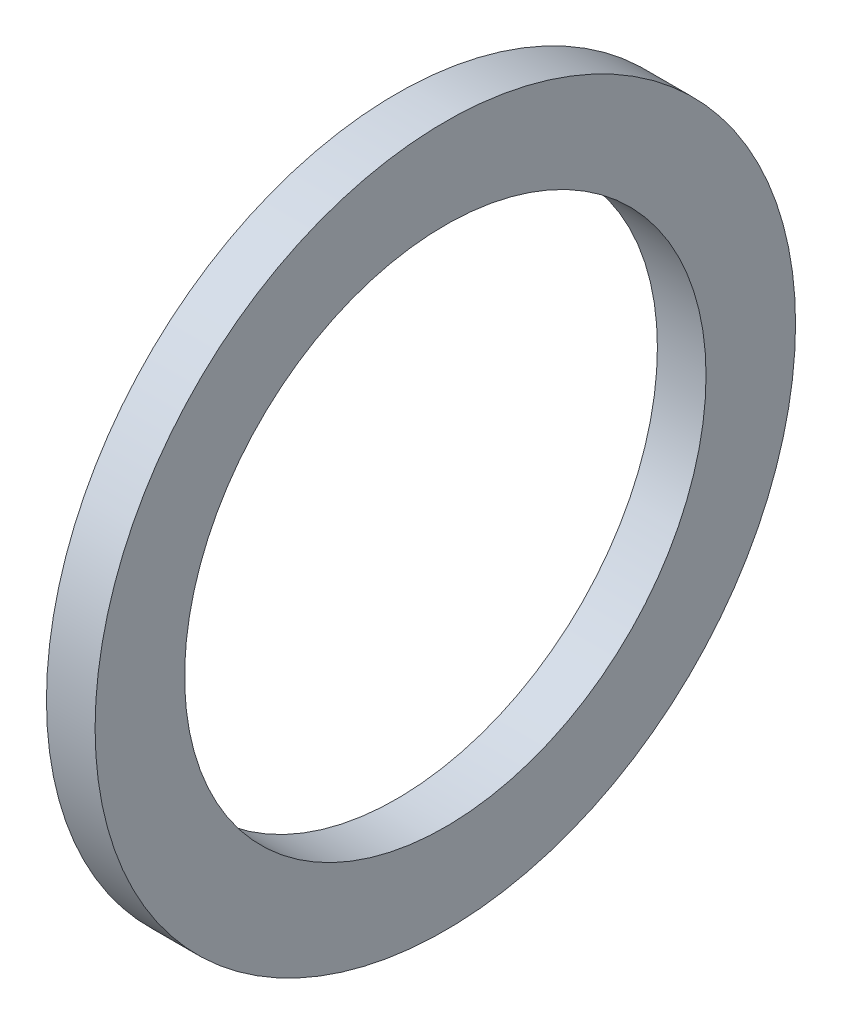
ISO-10303-21;
HEADER;
FILE_DESCRIPTION(('STEP AP214'),'2;1');
FILE_NAME('part.step','',(''),(''),'','','');
FILE_SCHEMA(('AUTOMOTIVE_DESIGN { 1 0 10303 214 1 1 1 1 }'));
ENDSEC;
DATA;
#1=APPLICATION_CONTEXT('core data for automotive mechanical design processes');
#2=APPLICATION_PROTOCOL_DEFINITION('international standard','automotive_design',2000,#1);
#3=PRODUCT_CONTEXT('',#1,'mechanical');
#4=PRODUCT('Part','Part','',(#3));
#5=PRODUCT_RELATED_PRODUCT_CATEGORY('part','',(#4));
#6=PRODUCT_DEFINITION_FORMATION('','',#4);
#7=PRODUCT_DEFINITION_CONTEXT('part definition',#1,'design');
#8=PRODUCT_DEFINITION('design','',#6,#7);
#9=PRODUCT_DEFINITION_SHAPE('','',#8);
#10=(LENGTH_UNIT() NAMED_UNIT(*) SI_UNIT(.MILLI.,.METRE.));
#11=(NAMED_UNIT(*) PLANE_ANGLE_UNIT() SI_UNIT($,.RADIAN.));
#12=(NAMED_UNIT(*) SI_UNIT($,.STERADIAN.) SOLID_ANGLE_UNIT());
#13=UNCERTAINTY_MEASURE_WITH_UNIT(LENGTH_MEASURE(1.E-05),#10,'distance_accuracy_value','');
#14=(GEOMETRIC_REPRESENTATION_CONTEXT(3) GLOBAL_UNCERTAINTY_ASSIGNED_CONTEXT((#13)) GLOBAL_UNIT_ASSIGNED_CONTEXT((#10,
#11,#12)) REPRESENTATION_CONTEXT('',''));
#15=CARTESIAN_POINT('',(0.,0.,0.));
#16=DIRECTION('',(0.,0.,1.));
#17=DIRECTION('',(1.,0.,0.));
#18=AXIS2_PLACEMENT_3D('',#15,#16,#17);
#19=CARTESIAN_POINT('',(-14.8457760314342,18.,0.));
#20=DIRECTION('',(-0.999999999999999,0.,0.));
#21=DIRECTION('',(0.,0.,1.));
#22=AXIS2_PLACEMENT_3D('',#19,#20,#21);
#23=PLANE('',#22);
#24=CARTESIAN_POINT('',(-14.8457760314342,0.,0.));
#25=DIRECTION('',(0.999999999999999,0.,0.));
#26=DIRECTION('',(0.,0.,-1.));
#27=AXIS2_PLACEMENT_3D('',#24,#25,#26);
#28=CIRCLE('',#27,13.4);
#29=CARTESIAN_POINT('',(-14.8457760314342,0.,-13.4));
#30=VERTEX_POINT('',#29);
#31=EDGE_CURVE('E10',#30,#30,#28,.T.);
#32=ORIENTED_EDGE('',*,*,#31,.T.);
#33=EDGE_LOOP('',(#32));
#34=FACE_BOUND('',#33,.T.);
#35=CARTESIAN_POINT('',(-14.8457760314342,0.,0.));
#36=DIRECTION('',(0.999999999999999,0.,0.));
#37=DIRECTION('',(0.,0.,-1.));
#38=AXIS2_PLACEMENT_3D('',#35,#36,#37);
#39=CIRCLE('',#38,18.);
#40=CARTESIAN_POINT('',(-14.8457760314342,0.,-18.));
#41=VERTEX_POINT('',#40);
#42=EDGE_CURVE('E46',#41,#41,#39,.T.);
#43=ORIENTED_EDGE('',*,*,#42,.F.);
#44=EDGE_LOOP('',(#43));
#45=FACE_BOUND('',#44,.T.);
#46=ADVANCED_FACE('F32',(#34,#45),#23,.T.);
#47=CARTESIAN_POINT('',(0.,0.,0.));
#48=DIRECTION('',(0.999999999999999,0.,0.));
#49=DIRECTION('',(0.,0.,-1.));
#50=AXIS2_PLACEMENT_3D('',#47,#48,#49);
#51=CYLINDRICAL_SURFACE('',#50,13.4);
#52=CARTESIAN_POINT('',(-12.3457760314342,0.,0.));
#53=DIRECTION('',(0.999999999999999,0.,0.));
#54=DIRECTION('',(0.,0.,-1.));
#55=AXIS2_PLACEMENT_3D('',#52,#53,#54);
#56=CIRCLE('',#55,13.4);
#57=CARTESIAN_POINT('',(-12.3457760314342,0.,-13.4));
#58=VERTEX_POINT('',#57);
#59=EDGE_CURVE('E38',#58,#58,#56,.T.);
#60=CARTESIAN_POINT('',(-12.3457760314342,0.,-13.4));
#61=CARTESIAN_POINT('',(-12.3718176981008,0.,-13.4));
#62=CARTESIAN_POINT('',(-12.3978593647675,0.,-13.4));
#63=CARTESIAN_POINT('',(-12.4499426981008,0.,-13.4));
#64=CARTESIAN_POINT('',(-12.4759843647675,0.,-13.4));
#65=CARTESIAN_POINT('',(-12.5280676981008,0.,-13.4));
#66=CARTESIAN_POINT('',(-12.5541093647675,0.,-13.4));
#67=CARTESIAN_POINT('',(-12.6061926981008,0.,-13.4));
#68=CARTESIAN_POINT('',(-12.6322343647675,0.,-13.4));
#69=CARTESIAN_POINT('',(-12.6843176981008,0.,-13.4));
#70=CARTESIAN_POINT('',(-12.7103593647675,0.,-13.4));
#71=CARTESIAN_POINT('',(-12.7624426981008,0.,-13.4));
#72=CARTESIAN_POINT('',(-12.7884843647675,0.,-13.4));
#73=CARTESIAN_POINT('',(-12.8405676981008,0.,-13.4));
#74=CARTESIAN_POINT('',(-12.8666093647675,0.,-13.4));
#75=CARTESIAN_POINT('',(-12.9186926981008,0.,-13.4));
#76=CARTESIAN_POINT('',(-12.9447343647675,0.,-13.4));
#77=CARTESIAN_POINT('',(-12.9968176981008,0.,-13.4));
#78=CARTESIAN_POINT('',(-13.0228593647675,0.,-13.4));
#79=CARTESIAN_POINT('',(-13.0749426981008,0.,-13.4));
#80=CARTESIAN_POINT('',(-13.1009843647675,0.,-13.4));
#81=CARTESIAN_POINT('',(-13.1530676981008,0.,-13.4));
#82=CARTESIAN_POINT('',(-13.1791093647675,0.,-13.4));
#83=CARTESIAN_POINT('',(-13.2311926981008,0.,-13.4));
#84=CARTESIAN_POINT('',(-13.2572343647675,0.,-13.4));
#85=CARTESIAN_POINT('',(-13.3093176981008,0.,-13.4));
#86=CARTESIAN_POINT('',(-13.3353593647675,0.,-13.4));
#87=CARTESIAN_POINT('',(-13.3874426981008,0.,-13.4));
#88=CARTESIAN_POINT('',(-13.4134843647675,0.,-13.4));
#89=CARTESIAN_POINT('',(-13.4655676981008,0.,-13.4));
#90=CARTESIAN_POINT('',(-13.4916093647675,0.,-13.4));
#91=CARTESIAN_POINT('',(-13.5436926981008,0.,-13.4));
#92=CARTESIAN_POINT('',(-13.5697343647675,0.,-13.4));
#93=CARTESIAN_POINT('',(-13.6218176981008,0.,-13.4));
#94=CARTESIAN_POINT('',(-13.6478593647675,0.,-13.4));
#95=CARTESIAN_POINT('',(-13.6999426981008,0.,-13.4));
#96=CARTESIAN_POINT('',(-13.7259843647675,0.,-13.4));
#97=CARTESIAN_POINT('',(-13.7780676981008,0.,-13.4));
#98=CARTESIAN_POINT('',(-13.8041093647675,0.,-13.4));
#99=CARTESIAN_POINT('',(-13.8561926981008,0.,-13.4));
#100=CARTESIAN_POINT('',(-13.8822343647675,0.,-13.4));
#101=CARTESIAN_POINT('',(-13.9343176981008,0.,-13.4));
#102=CARTESIAN_POINT('',(-13.9603593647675,0.,-13.4));
#103=CARTESIAN_POINT('',(-14.0124426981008,0.,-13.4));
#104=CARTESIAN_POINT('',(-14.0384843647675,0.,-13.4));
#105=CARTESIAN_POINT('',(-14.0905676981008,0.,-13.4));
#106=CARTESIAN_POINT('',(-14.1166093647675,0.,-13.4));
#107=CARTESIAN_POINT('',(-14.1686926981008,0.,-13.4));
#108=CARTESIAN_POINT('',(-14.1947343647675,0.,-13.4));
#109=CARTESIAN_POINT('',(-14.2468176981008,0.,-13.4));
#110=CARTESIAN_POINT('',(-14.2728593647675,0.,-13.4));
#111=CARTESIAN_POINT('',(-14.3249426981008,0.,-13.4));
#112=CARTESIAN_POINT('',(-14.3509843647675,0.,-13.4));
#113=CARTESIAN_POINT('',(-14.4030676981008,0.,-13.4));
#114=CARTESIAN_POINT('',(-14.4291093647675,0.,-13.4));
#115=CARTESIAN_POINT('',(-14.4811926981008,0.,-13.4));
#116=CARTESIAN_POINT('',(-14.5072343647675,0.,-13.4));
#117=CARTESIAN_POINT('',(-14.5593176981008,0.,-13.4));
#118=CARTESIAN_POINT('',(-14.5853593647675,0.,-13.4));
#119=CARTESIAN_POINT('',(-14.6374426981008,0.,-13.4));
#120=CARTESIAN_POINT('',(-14.6634843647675,0.,-13.4));
#121=CARTESIAN_POINT('',(-14.7155676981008,0.,-13.4));
#122=CARTESIAN_POINT('',(-14.7416093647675,0.,-13.4));
#123=CARTESIAN_POINT('',(-14.7936926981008,0.,-13.4));
#124=CARTESIAN_POINT('',(-14.8197343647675,0.,-13.4));
#125=CARTESIAN_POINT('',(-14.8457760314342,0.,-13.4));
#126=B_SPLINE_CURVE_WITH_KNOTS('',3,(#60,#61,#62,#63,#64,#65,#66,#67,#68,#69,#70,#71,#72,#73,
#74,#75,#76,#77,#78,#79,#80,#81,#82,#83,#84,#85,#86,#87,#88,#89,#90,#91,#92,#93,#94,#95,#96,#97,
#98,#99,#100,#101,#102,#103,#104,#105,#106,#107,#108,#109,#110,#111,#112,#113,#114,#115,#116,
#117,#118,#119,#120,#121,#122,#123,#124,#125),.UNSPECIFIED.,.F.,.F.,(4,2,2,2,2,2,2,2,2,2,2,2,2,
2,2,2,2,2,2,2,2,2,2,2,2,2,2,2,2,2,2,2,4),(0.,0.0781249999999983,0.156249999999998,
0.234374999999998,0.312499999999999,0.390624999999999,0.468749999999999,0.546874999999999,
0.624999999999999,0.703125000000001,0.781250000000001,0.859375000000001,0.937500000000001,
1.015625,1.09375,1.171875,1.25,1.328125,1.40625,1.484375,1.5625,1.640625,1.71875,1.796875,1.875,
1.953125,2.03125,2.109375,2.1875,2.265625,2.34375,2.421875,2.5),.UNSPECIFIED.);
#127=EDGE_CURVE('BSEAM56',#58,#30,#126,.T.);
#128=ORIENTED_EDGE('',*,*,#59,.T.);
#129=ORIENTED_EDGE('',*,*,#31,.F.);
#130=ORIENTED_EDGE('',*,*,#127,.T.);
#131=ORIENTED_EDGE('',*,*,#127,.F.);
#132=EDGE_LOOP('',(#128,#130,#129,#131));
#133=FACE_BOUND('',#132,.T.);
#134=ADVANCED_FACE('F56',(#133),#51,.F.);
#135=CARTESIAN_POINT('',(-12.3457760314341,18.,0.));
#136=DIRECTION('',(0.999999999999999,0.,0.));
#137=DIRECTION('',(0.,0.,-1.));
#138=AXIS2_PLACEMENT_3D('',#135,#136,#137);
#139=PLANE('',#138);
#140=CARTESIAN_POINT('',(-12.3457760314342,0.,0.));
#141=DIRECTION('',(0.999999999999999,0.,0.));
#142=DIRECTION('',(0.,0.,-1.));
#143=AXIS2_PLACEMENT_3D('',#140,#141,#142);
#144=CIRCLE('',#143,18.);
#145=CARTESIAN_POINT('',(-12.3457760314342,0.,-18.));
#146=VERTEX_POINT('',#145);
#147=EDGE_CURVE('E42',#146,#146,#144,.T.);
#148=ORIENTED_EDGE('',*,*,#147,.T.);
#149=EDGE_LOOP('',(#148));
#150=FACE_BOUND('',#149,.T.);
#151=ORIENTED_EDGE('',*,*,#59,.F.);
#152=EDGE_LOOP('',(#151));
#153=FACE_BOUND('',#152,.T.);
#154=ADVANCED_FACE('F60',(#150,#153),#139,.T.);
#155=CARTESIAN_POINT('',(0.,0.,0.));
#156=DIRECTION('',(0.999999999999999,0.,0.));
#157=DIRECTION('',(0.,0.,-1.));
#158=AXIS2_PLACEMENT_3D('',#155,#156,#157);
#159=CYLINDRICAL_SURFACE('',#158,18.);
#160=CARTESIAN_POINT('',(-14.8457760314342,0.,-18.));
#161=CARTESIAN_POINT('',(-14.8197343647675,0.,-18.));
#162=CARTESIAN_POINT('',(-14.7936926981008,0.,-18.));
#163=CARTESIAN_POINT('',(-14.7416093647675,0.,-18.));
#164=CARTESIAN_POINT('',(-14.7155676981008,0.,-18.));
#165=CARTESIAN_POINT('',(-14.6634843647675,0.,-18.));
#166=CARTESIAN_POINT('',(-14.6374426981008,0.,-18.));
#167=CARTESIAN_POINT('',(-14.5853593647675,0.,-18.));
#168=CARTESIAN_POINT('',(-14.5593176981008,0.,-18.));
#169=CARTESIAN_POINT('',(-14.5072343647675,0.,-18.));
#170=CARTESIAN_POINT('',(-14.4811926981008,0.,-18.));
#171=CARTESIAN_POINT('',(-14.4291093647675,0.,-18.));
#172=CARTESIAN_POINT('',(-14.4030676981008,0.,-18.));
#173=CARTESIAN_POINT('',(-14.3509843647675,0.,-18.));
#174=CARTESIAN_POINT('',(-14.3249426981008,0.,-18.));
#175=CARTESIAN_POINT('',(-14.2728593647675,0.,-18.));
#176=CARTESIAN_POINT('',(-14.2468176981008,0.,-18.));
#177=CARTESIAN_POINT('',(-14.1947343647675,0.,-18.));
#178=CARTESIAN_POINT('',(-14.1686926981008,0.,-18.));
#179=CARTESIAN_POINT('',(-14.1166093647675,0.,-18.));
#180=CARTESIAN_POINT('',(-14.0905676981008,0.,-18.));
#181=CARTESIAN_POINT('',(-14.0384843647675,0.,-18.));
#182=CARTESIAN_POINT('',(-14.0124426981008,0.,-18.));
#183=CARTESIAN_POINT('',(-13.9603593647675,0.,-18.));
#184=CARTESIAN_POINT('',(-13.9343176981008,0.,-18.));
#185=CARTESIAN_POINT('',(-13.8822343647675,0.,-18.));
#186=CARTESIAN_POINT('',(-13.8561926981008,0.,-18.));
#187=CARTESIAN_POINT('',(-13.8041093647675,0.,-18.));
#188=CARTESIAN_POINT('',(-13.7780676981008,0.,-18.));
#189=CARTESIAN_POINT('',(-13.7259843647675,0.,-18.));
#190=CARTESIAN_POINT('',(-13.6999426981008,0.,-18.));
#191=CARTESIAN_POINT('',(-13.6478593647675,0.,-18.));
#192=CARTESIAN_POINT('',(-13.6218176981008,0.,-18.));
#193=CARTESIAN_POINT('',(-13.5697343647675,0.,-18.));
#194=CARTESIAN_POINT('',(-13.5436926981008,0.,-18.));
#195=CARTESIAN_POINT('',(-13.4916093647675,0.,-18.));
#196=CARTESIAN_POINT('',(-13.4655676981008,0.,-18.));
#197=CARTESIAN_POINT('',(-13.4134843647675,0.,-18.));
#198=CARTESIAN_POINT('',(-13.3874426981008,0.,-18.));
#199=CARTESIAN_POINT('',(-13.3353593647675,0.,-18.));
#200=CARTESIAN_POINT('',(-13.3093176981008,0.,-18.));
#201=CARTESIAN_POINT('',(-13.2572343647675,0.,-18.));
#202=CARTESIAN_POINT('',(-13.2311926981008,0.,-18.));
#203=CARTESIAN_POINT('',(-13.1791093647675,0.,-18.));
#204=CARTESIAN_POINT('',(-13.1530676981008,0.,-18.));
#205=CARTESIAN_POINT('',(-13.1009843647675,0.,-18.));
#206=CARTESIAN_POINT('',(-13.0749426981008,0.,-18.));
#207=CARTESIAN_POINT('',(-13.0228593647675,0.,-18.));
#208=CARTESIAN_POINT('',(-12.9968176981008,0.,-18.));
#209=CARTESIAN_POINT('',(-12.9447343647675,0.,-18.));
#210=CARTESIAN_POINT('',(-12.9186926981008,0.,-18.));
#211=CARTESIAN_POINT('',(-12.8666093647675,0.,-18.));
#212=CARTESIAN_POINT('',(-12.8405676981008,0.,-18.));
#213=CARTESIAN_POINT('',(-12.7884843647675,0.,-18.));
#214=CARTESIAN_POINT('',(-12.7624426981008,0.,-18.));
#215=CARTESIAN_POINT('',(-12.7103593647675,0.,-18.));
#216=CARTESIAN_POINT('',(-12.6843176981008,0.,-18.));
#217=CARTESIAN_POINT('',(-12.6322343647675,0.,-18.));
#218=CARTESIAN_POINT('',(-12.6061926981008,0.,-18.));
#219=CARTESIAN_POINT('',(-12.5541093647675,0.,-18.));
#220=CARTESIAN_POINT('',(-12.5280676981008,0.,-18.));
#221=CARTESIAN_POINT('',(-12.4759843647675,0.,-18.));
#222=CARTESIAN_POINT('',(-12.4499426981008,0.,-18.));
#223=CARTESIAN_POINT('',(-12.3978593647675,0.,-18.));
#224=CARTESIAN_POINT('',(-12.3718176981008,0.,-18.));
#225=CARTESIAN_POINT('',(-12.3457760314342,0.,-18.));
#226=B_SPLINE_CURVE_WITH_KNOTS('',3,(#160,#161,#162,#163,#164,#165,#166,#167,#168,#169,#170,
#171,#172,#173,#174,#175,#176,#177,#178,#179,#180,#181,#182,#183,#184,#185,#186,#187,#188,#189,
#190,#191,#192,#193,#194,#195,#196,#197,#198,#199,#200,#201,#202,#203,#204,#205,#206,#207,#208,
#209,#210,#211,#212,#213,#214,#215,#216,#217,#218,#219,#220,#221,#222,#223,#224,#225),
.UNSPECIFIED.,.F.,.F.,(4,2,2,2,2,2,2,2,2,2,2,2,2,2,2,2,2,2,2,2,2,2,2,2,2,2,2,2,2,2,2,2,4),(0.,
0.0781250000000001,0.15625,0.234375,0.3125,0.390625,0.46875,0.546875,0.625000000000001,
0.703125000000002,0.781250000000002,0.859375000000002,0.937500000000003,1.015625,1.09375,
1.171875,1.25,1.328125,1.40625,1.484375,1.5625,1.640625,1.71875,1.796875,1.875,1.953125,2.03125,
2.109375,2.1875,2.265625,2.34375,2.421875,2.5),.UNSPECIFIED.);
#227=EDGE_CURVE('BSEAM52',#41,#146,#226,.T.);
#228=ORIENTED_EDGE('',*,*,#42,.T.);
#229=ORIENTED_EDGE('',*,*,#147,.F.);
#230=ORIENTED_EDGE('',*,*,#227,.T.);
#231=ORIENTED_EDGE('',*,*,#227,.F.);
#232=EDGE_LOOP('',(#228,#230,#229,#231));
#233=FACE_BOUND('',#232,.T.);
#234=ADVANCED_FACE('F52',(#233),#159,.T.);
#235=CLOSED_SHELL('',(#46,#134,#154,#234));
#236=MANIFOLD_SOLID_BREP('B2',#235);
#237=ADVANCED_BREP_SHAPE_REPRESENTATION('',(#18,#236),#14);
#238=SHAPE_DEFINITION_REPRESENTATION(#9,#237);
ENDSEC;
END-ISO-10303-21;
